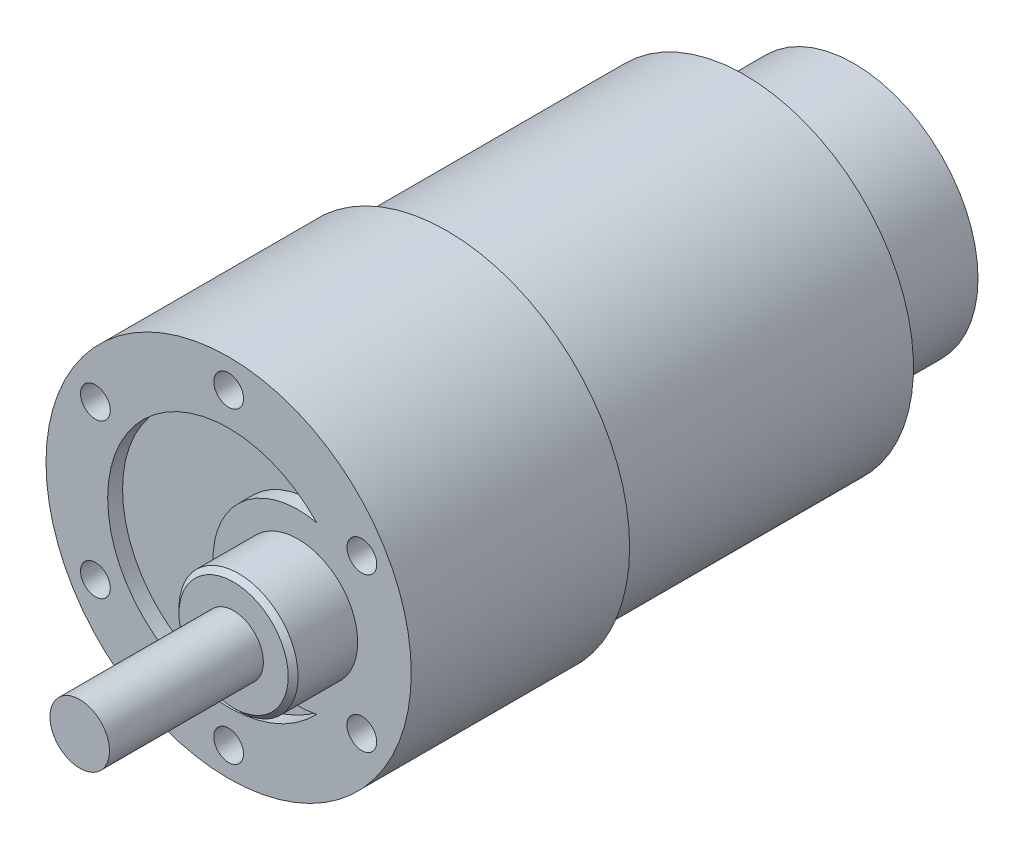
ISO-10303-21;
HEADER;
FILE_DESCRIPTION(('STEP AP214'),'2;1');
FILE_NAME('part.step','',(''),(''),'','','');
FILE_SCHEMA(('AUTOMOTIVE_DESIGN { 1 0 10303 214 1 1 1 1 }'));
ENDSEC;
DATA;
#1=APPLICATION_CONTEXT('core data for automotive mechanical design processes');
#2=APPLICATION_PROTOCOL_DEFINITION('international standard','automotive_design',2000,#1);
#3=PRODUCT_CONTEXT('',#1,'mechanical');
#4=PRODUCT('Part','Part','',(#3));
#5=PRODUCT_RELATED_PRODUCT_CATEGORY('part','',(#4));
#6=PRODUCT_DEFINITION_FORMATION('','',#4);
#7=PRODUCT_DEFINITION_CONTEXT('part definition',#1,'design');
#8=PRODUCT_DEFINITION('design','',#6,#7);
#9=PRODUCT_DEFINITION_SHAPE('','',#8);
#10=(LENGTH_UNIT() NAMED_UNIT(*) SI_UNIT(.MILLI.,.METRE.));
#11=(NAMED_UNIT(*) PLANE_ANGLE_UNIT() SI_UNIT($,.RADIAN.));
#12=(NAMED_UNIT(*) SI_UNIT($,.STERADIAN.) SOLID_ANGLE_UNIT());
#13=UNCERTAINTY_MEASURE_WITH_UNIT(LENGTH_MEASURE(1.E-05),#10,'distance_accuracy_value','');
#14=(GEOMETRIC_REPRESENTATION_CONTEXT(3) GLOBAL_UNCERTAINTY_ASSIGNED_CONTEXT((#13)) GLOBAL_UNIT_ASSIGNED_CONTEXT((#10,
#11,#12)) REPRESENTATION_CONTEXT('',''));
#15=CARTESIAN_POINT('',(0.,0.,0.));
#16=DIRECTION('',(0.,0.,1.));
#17=DIRECTION('',(1.,0.,0.));
#18=AXIS2_PLACEMENT_3D('',#15,#16,#17);
#19=CARTESIAN_POINT('',(0.,0.,0.));
#20=DIRECTION('',(0.,0.,-1.));
#21=DIRECTION('',(-1.,0.,0.));
#22=AXIS2_PLACEMENT_3D('',#19,#20,#21);
#23=PLANE('',#22);
#24=CARTESIAN_POINT('',(0.,0.,0.));
#25=DIRECTION('',(0.,0.,-1.));
#26=DIRECTION('',(-1.,0.,0.));
#27=AXIS2_PLACEMENT_3D('',#24,#25,#26);
#28=CIRCLE('',#27,17.);
#29=CARTESIAN_POINT('',(-17.,0.,0.));
#30=VERTEX_POINT('',#29);
#31=EDGE_CURVE('E87',#30,#30,#28,.T.);
#32=ORIENTED_EDGE('',*,*,#31,.T.);
#33=EDGE_LOOP('',(#32));
#34=FACE_BOUND('',#33,.T.);
#35=CARTESIAN_POINT('',(0.,0.,0.));
#36=DIRECTION('',(0.,0.,-1.));
#37=DIRECTION('',(-1.,0.,0.));
#38=AXIS2_PLACEMENT_3D('',#35,#36,#37);
#39=CIRCLE('',#38,12.5);
#40=CARTESIAN_POINT('',(-12.5,0.,0.));
#41=VERTEX_POINT('',#40);
#42=EDGE_CURVE('E64',#41,#41,#39,.T.);
#43=ORIENTED_EDGE('',*,*,#42,.F.);
#44=EDGE_LOOP('',(#43));
#45=FACE_BOUND('',#44,.T.);
#46=ADVANCED_FACE('F33',(#34,#45),#23,.T.);
#47=CARTESIAN_POINT('',(0.,0.,52.));
#48=DIRECTION('',(0.,0.,-1.));
#49=DIRECTION('',(-1.,0.,0.));
#50=AXIS2_PLACEMENT_3D('',#47,#48,#49);
#51=CYLINDRICAL_SURFACE('',#50,18.4);
#52=CARTESIAN_POINT('',(0.,0.,52.));
#53=DIRECTION('',(0.,0.,-1.));
#54=DIRECTION('',(-1.,0.,0.));
#55=AXIS2_PLACEMENT_3D('',#52,#53,#54);
#56=CIRCLE('',#55,18.4);
#57=CARTESIAN_POINT('',(-18.4,0.,52.));
#58=VERTEX_POINT('',#57);
#59=EDGE_CURVE('E101',#58,#58,#56,.T.);
#60=ORIENTED_EDGE('',*,*,#59,.T.);
#61=EDGE_LOOP('',(#60));
#62=FACE_BOUND('',#61,.T.);
#63=CARTESIAN_POINT('',(0.,0.,30.));
#64=DIRECTION('',(0.,0.,-1.));
#65=DIRECTION('',(-1.,0.,0.));
#66=AXIS2_PLACEMENT_3D('',#63,#64,#65);
#67=CIRCLE('',#66,18.4);
#68=CARTESIAN_POINT('',(-18.4,0.,30.));
#69=VERTEX_POINT('',#68);
#70=EDGE_CURVE('E92',#69,#69,#67,.T.);
#71=ORIENTED_EDGE('',*,*,#70,.F.);
#72=EDGE_LOOP('',(#71));
#73=FACE_BOUND('',#72,.T.);
#74=ADVANCED_FACE('F123',(#62,#73),#51,.T.);
#75=CARTESIAN_POINT('',(18.4,0.,52.));
#76=DIRECTION('',(0.,0.,1.));
#77=DIRECTION('',(1.,0.,0.));
#78=AXIS2_PLACEMENT_3D('',#75,#76,#77);
#79=PLANE('',#78);
#80=CARTESIAN_POINT('',(-13.4233937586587,7.75000000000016,52.));
#81=DIRECTION('',(0.,0.,1.));
#82=DIRECTION('',(1.,0.,0.));
#83=AXIS2_PLACEMENT_3D('',#80,#81,#82);
#84=CIRCLE('',#83,1.49999999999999);
#85=CARTESIAN_POINT('',(-11.9233937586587,7.75000000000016,52.));
#86=VERTEX_POINT('',#85);
#87=EDGE_CURVE('E154',#86,#86,#84,.T.);
#88=ORIENTED_EDGE('',*,*,#87,.F.);
#89=EDGE_LOOP('',(#88));
#90=FACE_BOUND('',#89,.T.);
#91=CARTESIAN_POINT('',(-13.4233937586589,-7.74999999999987,52.));
#92=DIRECTION('',(0.,0.,1.));
#93=DIRECTION('',(1.,0.,0.));
#94=AXIS2_PLACEMENT_3D('',#91,#92,#93);
#95=CIRCLE('',#94,1.49999999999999);
#96=CARTESIAN_POINT('',(-11.9233937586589,-7.74999999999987,52.));
#97=VERTEX_POINT('',#96);
#98=EDGE_CURVE('E158',#97,#97,#95,.T.);
#99=ORIENTED_EDGE('',*,*,#98,.F.);
#100=EDGE_LOOP('',(#99));
#101=FACE_BOUND('',#100,.T.);
#102=CARTESIAN_POINT('',(-1.08235921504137E-13,-15.5,52.));
#103=DIRECTION('',(0.,0.,1.));
#104=DIRECTION('',(1.,0.,0.));
#105=AXIS2_PLACEMENT_3D('',#102,#103,#104);
#106=CIRCLE('',#105,1.49999999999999);
#107=CARTESIAN_POINT('',(1.49999999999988,-15.5,52.));
#108=VERTEX_POINT('',#107);
#109=EDGE_CURVE('E162',#108,#108,#106,.T.);
#110=ORIENTED_EDGE('',*,*,#109,.F.);
#111=EDGE_LOOP('',(#110));
#112=FACE_BOUND('',#111,.T.);
#113=CARTESIAN_POINT('',(13.4233937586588,-7.75000000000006,52.));
#114=DIRECTION('',(0.,0.,1.));
#115=DIRECTION('',(1.,0.,0.));
#116=AXIS2_PLACEMENT_3D('',#113,#114,#115);
#117=CIRCLE('',#116,1.49999999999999);
#118=CARTESIAN_POINT('',(14.9233937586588,-7.75000000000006,52.));
#119=VERTEX_POINT('',#118);
#120=EDGE_CURVE('E166',#119,#119,#117,.T.);
#121=ORIENTED_EDGE('',*,*,#120,.F.);
#122=EDGE_LOOP('',(#121));
#123=FACE_BOUND('',#122,.T.);
#124=CARTESIAN_POINT('',(13.4233937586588,7.74999999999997,52.));
#125=DIRECTION('',(0.,0.,1.));
#126=DIRECTION('',(1.,0.,0.));
#127=AXIS2_PLACEMENT_3D('',#124,#125,#126);
#128=CIRCLE('',#127,1.49999999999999);
#129=CARTESIAN_POINT('',(14.9233937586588,7.74999999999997,52.));
#130=VERTEX_POINT('',#129);
#131=EDGE_CURVE('E170',#130,#130,#128,.T.);
#132=ORIENTED_EDGE('',*,*,#131,.F.);
#133=EDGE_LOOP('',(#132));
#134=FACE_BOUND('',#133,.T.);
#135=CARTESIAN_POINT('',(0.,15.5,52.));
#136=DIRECTION('',(0.,0.,1.));
#137=DIRECTION('',(1.,0.,0.));
#138=AXIS2_PLACEMENT_3D('',#135,#136,#137);
#139=CIRCLE('',#138,1.49999999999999);
#140=CARTESIAN_POINT('',(1.49999999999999,15.5,52.));
#141=VERTEX_POINT('',#140);
#142=EDGE_CURVE('E174',#141,#141,#139,.T.);
#143=ORIENTED_EDGE('',*,*,#142,.F.);
#144=EDGE_LOOP('',(#143));
#145=FACE_BOUND('',#144,.T.);
#146=CARTESIAN_POINT('',(7.,0.,52.));
#147=DIRECTION('',(0.,0.,1.));
#148=DIRECTION('',(1.,0.,0.));
#149=AXIS2_PLACEMENT_3D('',#146,#147,#148);
#150=CIRCLE('',#149,6.);
#151=CARTESIAN_POINT('',(13.,0.,52.));
#152=VERTEX_POINT('',#151);
#153=EDGE_CURVE('E104',#152,#152,#150,.T.);
#154=ORIENTED_EDGE('',*,*,#153,.F.);
#155=EDGE_LOOP('',(#154));
#156=FACE_BOUND('',#155,.T.);
#157=CARTESIAN_POINT('',(7.,0.,52.));
#158=DIRECTION('',(0.,0.,-1.));
#159=DIRECTION('',(-1.,0.,0.));
#160=AXIS2_PLACEMENT_3D('',#157,#158,#159);
#161=CIRCLE('',#160,8.56590718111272);
#162=CARTESIAN_POINT('',(8.86813473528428,-8.35971521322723,52.));
#163=VERTEX_POINT('',#162);
#164=CARTESIAN_POINT('',(8.86813473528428,8.35971521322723,52.));
#165=VERTEX_POINT('',#164);
#166=EDGE_CURVE('E48',#163,#165,#161,.T.);
#167=ORIENTED_EDGE('',*,*,#166,.F.);
#168=CARTESIAN_POINT('',(0.,0.,52.));
#169=DIRECTION('',(0.,0.,1.));
#170=DIRECTION('',(1.,0.,0.));
#171=AXIS2_PLACEMENT_3D('',#168,#169,#170);
#172=CIRCLE('',#171,12.1872331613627);
#173=EDGE_CURVE('E68',#165,#163,#172,.T.);
#174=ORIENTED_EDGE('',*,*,#173,.F.);
#175=EDGE_LOOP('',(#167,#174));
#176=FACE_BOUND('',#175,.T.);
#177=ORIENTED_EDGE('',*,*,#59,.F.);
#178=EDGE_LOOP('',(#177));
#179=FACE_BOUND('',#178,.T.);
#180=ADVANCED_FACE('F72',(#90,#101,#112,#123,#134,#145,#156,#176,#179),#79,.T.);
#181=CARTESIAN_POINT('',(0.,0.,29.));
#182=DIRECTION('',(0.,0.,-1.));
#183=DIRECTION('',(-1.,0.,0.));
#184=AXIS2_PLACEMENT_3D('',#181,#182,#183);
#185=TOROIDAL_SURFACE('',#184,16.,1.);
#186=CARTESIAN_POINT('',(0.,0.,30.));
#187=DIRECTION('',(0.,0.,-1.));
#188=DIRECTION('',(-1.,0.,0.));
#189=AXIS2_PLACEMENT_3D('',#186,#187,#188);
#190=CIRCLE('',#189,16.);
#191=CARTESIAN_POINT('',(-16.,0.,30.));
#192=VERTEX_POINT('',#191);
#193=EDGE_CURVE('E95',#192,#192,#190,.T.);
#194=ORIENTED_EDGE('',*,*,#193,.T.);
#195=EDGE_LOOP('',(#194));
#196=FACE_BOUND('',#195,.T.);
#197=CARTESIAN_POINT('',(0.,0.,29.));
#198=DIRECTION('',(0.,0.,-1.));
#199=DIRECTION('',(-1.,0.,0.));
#200=AXIS2_PLACEMENT_3D('',#197,#198,#199);
#201=CIRCLE('',#200,17.);
#202=CARTESIAN_POINT('',(-17.,0.,29.));
#203=VERTEX_POINT('',#202);
#204=EDGE_CURVE('E98',#203,#203,#201,.T.);
#205=ORIENTED_EDGE('',*,*,#204,.F.);
#206=EDGE_LOOP('',(#205));
#207=FACE_BOUND('',#206,.T.);
#208=ADVANCED_FACE('F142',(#196,#207),#185,.T.);
#209=CARTESIAN_POINT('',(16.,0.,30.));
#210=DIRECTION('',(0.,0.,-1.));
#211=DIRECTION('',(-1.,0.,0.));
#212=AXIS2_PLACEMENT_3D('',#209,#210,#211);
#213=PLANE('',#212);
#214=ORIENTED_EDGE('',*,*,#70,.T.);
#215=EDGE_LOOP('',(#214));
#216=FACE_BOUND('',#215,.T.);
#217=ORIENTED_EDGE('',*,*,#193,.F.);
#218=EDGE_LOOP('',(#217));
#219=FACE_BOUND('',#218,.T.);
#220=ADVANCED_FACE('F138',(#216,#219),#213,.T.);
#221=CARTESIAN_POINT('',(0.,0.,0.));
#222=DIRECTION('',(0.,0.,1.));
#223=DIRECTION('',(1.,0.,0.));
#224=AXIS2_PLACEMENT_3D('',#221,#222,#223);
#225=CYLINDRICAL_SURFACE('',#224,17.);
#226=ORIENTED_EDGE('',*,*,#31,.F.);
#227=EDGE_LOOP('',(#226));
#228=FACE_BOUND('',#227,.T.);
#229=ORIENTED_EDGE('',*,*,#204,.T.);
#230=EDGE_LOOP('',(#229));
#231=FACE_BOUND('',#230,.T.);
#232=ADVANCED_FACE('F135',(#228,#231),#225,.T.);
#233=CARTESIAN_POINT('',(0.,0.,-11.));
#234=DIRECTION('',(0.,0.,1.));
#235=DIRECTION('',(1.,0.,0.));
#236=AXIS2_PLACEMENT_3D('',#233,#234,#235);
#237=CYLINDRICAL_SURFACE('',#236,12.5);
#238=CARTESIAN_POINT('',(0.,0.,-11.));
#239=DIRECTION('',(0.,0.,-1.));
#240=DIRECTION('',(-1.,0.,0.));
#241=AXIS2_PLACEMENT_3D('',#238,#239,#240);
#242=CIRCLE('',#241,12.5);
#243=CARTESIAN_POINT('',(-12.5,0.,-11.));
#244=VERTEX_POINT('',#243);
#245=EDGE_CURVE('E84',#244,#244,#242,.T.);
#246=ORIENTED_EDGE('',*,*,#245,.F.);
#247=EDGE_LOOP('',(#246));
#248=FACE_BOUND('',#247,.T.);
#249=ORIENTED_EDGE('',*,*,#42,.T.);
#250=EDGE_LOOP('',(#249));
#251=FACE_BOUND('',#250,.T.);
#252=ADVANCED_FACE('F133',(#248,#251),#237,.T.);
#253=CARTESIAN_POINT('',(0.,0.,-11.));
#254=DIRECTION('',(0.,0.,-1.));
#255=DIRECTION('',(-1.,0.,0.));
#256=AXIS2_PLACEMENT_3D('',#253,#254,#255);
#257=PLANE('',#256);
#258=ORIENTED_EDGE('',*,*,#245,.T.);
#259=EDGE_LOOP('',(#258));
#260=FACE_BOUND('',#259,.T.);
#261=ADVANCED_FACE('F202',(#260),#257,.T.);
#262=CARTESIAN_POINT('',(7.,0.,50.5));
#263=DIRECTION('',(0.,0.,1.));
#264=DIRECTION('',(1.,0.,0.));
#265=AXIS2_PLACEMENT_3D('',#262,#263,#264);
#266=CYLINDRICAL_SURFACE('',#265,8.56590718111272);
#267=ORIENTED_EDGE('',*,*,#166,.T.);
#268=DIRECTION('',(0.,0.,1.));
#269=VECTOR('',#268,1.);
#270=CARTESIAN_POINT('',(8.86813473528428,8.35971521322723,50.5));
#271=LINE('',#270,#269);
#272=CARTESIAN_POINT('',(8.86813473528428,8.35971521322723,50.5));
#273=VERTEX_POINT('',#272);
#274=EDGE_CURVE('E65',#273,#165,#271,.T.);
#275=ORIENTED_EDGE('',*,*,#274,.F.);
#276=CARTESIAN_POINT('',(7.,0.,50.5));
#277=DIRECTION('',(0.,0.,-1.));
#278=DIRECTION('',(-1.,0.,0.));
#279=AXIS2_PLACEMENT_3D('',#276,#277,#278);
#280=CIRCLE('',#279,8.56590718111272);
#281=CARTESIAN_POINT('',(8.86813473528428,-8.35971521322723,50.5));
#282=VERTEX_POINT('',#281);
#283=EDGE_CURVE('E62',#282,#273,#280,.T.);
#284=ORIENTED_EDGE('',*,*,#283,.F.);
#285=DIRECTION('',(0.,0.,1.));
#286=VECTOR('',#285,1.);
#287=CARTESIAN_POINT('',(8.86813473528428,-8.35971521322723,50.5));
#288=LINE('',#287,#286);
#289=EDGE_CURVE('E56',#282,#163,#288,.T.);
#290=ORIENTED_EDGE('',*,*,#289,.T.);
#291=EDGE_LOOP('',(#267,#275,#284,#290));
#292=FACE_BOUND('',#291,.T.);
#293=ADVANCED_FACE('F60',(#292),#266,.T.);
#294=CARTESIAN_POINT('',(0.,0.,50.5));
#295=DIRECTION('',(0.,0.,1.));
#296=DIRECTION('',(1.,0.,0.));
#297=AXIS2_PLACEMENT_3D('',#294,#295,#296);
#298=CYLINDRICAL_SURFACE('',#297,12.1872331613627);
#299=ORIENTED_EDGE('',*,*,#173,.T.);
#300=ORIENTED_EDGE('',*,*,#289,.F.);
#301=CARTESIAN_POINT('',(0.,0.,50.5));
#302=DIRECTION('',(0.,0.,1.));
#303=DIRECTION('',(1.,0.,0.));
#304=AXIS2_PLACEMENT_3D('',#301,#302,#303);
#305=CIRCLE('',#304,12.1872331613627);
#306=EDGE_CURVE('E80',#273,#282,#305,.T.);
#307=ORIENTED_EDGE('',*,*,#306,.F.);
#308=ORIENTED_EDGE('',*,*,#274,.T.);
#309=EDGE_LOOP('',(#299,#300,#307,#308));
#310=FACE_BOUND('',#309,.T.);
#311=ADVANCED_FACE('F69',(#310),#298,.F.);
#312=CARTESIAN_POINT('',(3.5,0.,50.5));
#313=DIRECTION('',(0.,0.,-1.));
#314=DIRECTION('',(-1.,0.,0.));
#315=AXIS2_PLACEMENT_3D('',#312,#313,#314);
#316=PLANE('',#315);
#317=ORIENTED_EDGE('',*,*,#283,.T.);
#318=ORIENTED_EDGE('',*,*,#306,.T.);
#319=EDGE_LOOP('',(#317,#318));
#320=FACE_BOUND('',#319,.T.);
#321=ADVANCED_FACE('F194',(#320),#316,.F.);
#322=CARTESIAN_POINT('',(7.,0.,74.));
#323=DIRECTION('',(0.,0.,-1.));
#324=DIRECTION('',(-1.,0.,0.));
#325=AXIS2_PLACEMENT_3D('',#322,#323,#324);
#326=CYLINDRICAL_SURFACE('',#325,3.);
#327=CARTESIAN_POINT('',(7.,0.,74.));
#328=DIRECTION('',(0.,0.,-1.));
#329=DIRECTION('',(-1.,0.,0.));
#330=AXIS2_PLACEMENT_3D('',#327,#328,#329);
#331=CIRCLE('',#330,3.);
#332=CARTESIAN_POINT('',(4.,0.,74.));
#333=VERTEX_POINT('',#332);
#334=EDGE_CURVE('E74',#333,#333,#331,.T.);
#335=ORIENTED_EDGE('',*,*,#334,.T.);
#336=EDGE_LOOP('',(#335));
#337=FACE_BOUND('',#336,.T.);
#338=CARTESIAN_POINT('',(7.,0.,58.5));
#339=DIRECTION('',(0.,0.,-1.));
#340=DIRECTION('',(-1.,0.,0.));
#341=AXIS2_PLACEMENT_3D('',#338,#339,#340);
#342=CIRCLE('',#341,3.);
#343=CARTESIAN_POINT('',(4.,0.,58.5));
#344=VERTEX_POINT('',#343);
#345=EDGE_CURVE('E77',#344,#344,#342,.T.);
#346=ORIENTED_EDGE('',*,*,#345,.F.);
#347=EDGE_LOOP('',(#346));
#348=FACE_BOUND('',#347,.T.);
#349=ADVANCED_FACE('F187',(#337,#348),#326,.T.);
#350=CARTESIAN_POINT('',(10.,0.,74.));
#351=DIRECTION('',(0.,0.,1.));
#352=DIRECTION('',(1.,0.,0.));
#353=AXIS2_PLACEMENT_3D('',#350,#351,#352);
#354=PLANE('',#353);
#355=ORIENTED_EDGE('',*,*,#334,.F.);
#356=EDGE_LOOP('',(#355));
#357=FACE_BOUND('',#356,.T.);
#358=ADVANCED_FACE('F178',(#357),#354,.T.);
#359=CARTESIAN_POINT('',(7.,0.,74.));
#360=DIRECTION('',(0.,0.,-1.));
#361=DIRECTION('',(-1.,0.,0.));
#362=AXIS2_PLACEMENT_3D('',#359,#360,#361);
#363=CYLINDRICAL_SURFACE('',#362,6.);
#364=CARTESIAN_POINT('',(7.,0.,57.9999999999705));
#365=DIRECTION('',(0.,0.,1.));
#366=DIRECTION('',(1.,0.,0.));
#367=AXIS2_PLACEMENT_3D('',#364,#365,#366);
#368=CIRCLE('',#367,6.);
#369=CARTESIAN_POINT('',(13.,0.,57.9999999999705));
#370=VERTEX_POINT('',#369);
#371=EDGE_CURVE('E41',#370,#370,#368,.F.);
#372=ORIENTED_EDGE('',*,*,#371,.T.);
#373=EDGE_LOOP('',(#372));
#374=FACE_BOUND('',#373,.T.);
#375=ORIENTED_EDGE('',*,*,#153,.T.);
#376=EDGE_LOOP('',(#375));
#377=FACE_BOUND('',#376,.T.);
#378=ADVANCED_FACE('F109',(#374,#377),#363,.T.);
#379=CARTESIAN_POINT('',(13.,0.,58.5));
#380=DIRECTION('',(0.,0.,1.));
#381=DIRECTION('',(1.,0.,0.));
#382=AXIS2_PLACEMENT_3D('',#379,#380,#381);
#383=PLANE('',#382);
#384=CARTESIAN_POINT('',(7.,0.,58.5));
#385=DIRECTION('',(0.,0.,1.));
#386=DIRECTION('',(1.,0.,0.));
#387=AXIS2_PLACEMENT_3D('',#384,#385,#386);
#388=CIRCLE('',#387,5.50000000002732);
#389=CARTESIAN_POINT('',(12.5000000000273,0.,58.5));
#390=VERTEX_POINT('',#389);
#391=EDGE_CURVE('E11',#390,#390,#388,.T.);
#392=ORIENTED_EDGE('',*,*,#391,.T.);
#393=EDGE_LOOP('',(#392));
#394=FACE_BOUND('',#393,.T.);
#395=ORIENTED_EDGE('',*,*,#345,.T.);
#396=EDGE_LOOP('',(#395));
#397=FACE_BOUND('',#396,.T.);
#398=ADVANCED_FACE('F177',(#394,#397),#383,.T.);
#399=CARTESIAN_POINT('',(0.,15.5,49.));
#400=DIRECTION('',(0.,0.,-1.));
#401=DIRECTION('',(-1.,0.,0.));
#402=AXIS2_PLACEMENT_3D('',#399,#400,#401);
#403=PLANE('',#402);
#404=CARTESIAN_POINT('',(0.,15.5,49.));
#405=DIRECTION('',(0.,0.,1.));
#406=DIRECTION('',(1.,0.,0.));
#407=AXIS2_PLACEMENT_3D('',#404,#405,#406);
#408=CIRCLE('',#407,1.49999999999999);
#409=CARTESIAN_POINT('',(1.49999999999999,15.5,49.));
#410=VERTEX_POINT('',#409);
#411=EDGE_CURVE('E434',#410,#410,#408,.T.);
#412=ORIENTED_EDGE('',*,*,#411,.T.);
#413=EDGE_LOOP('',(#412));
#414=FACE_BOUND('',#413,.T.);
#415=ADVANCED_FACE('F184',(#414),#403,.F.);
#416=CARTESIAN_POINT('',(0.,15.5,52.));
#417=DIRECTION('',(0.,0.,1.));
#418=DIRECTION('',(1.,0.,0.));
#419=AXIS2_PLACEMENT_3D('',#416,#417,#418);
#420=CYLINDRICAL_SURFACE('',#419,1.49999999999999);
#421=ORIENTED_EDGE('',*,*,#411,.F.);
#422=EDGE_LOOP('',(#421));
#423=FACE_BOUND('',#422,.T.);
#424=ORIENTED_EDGE('',*,*,#142,.T.);
#425=EDGE_LOOP('',(#424));
#426=FACE_BOUND('',#425,.T.);
#427=ADVANCED_FACE('F249',(#423,#426),#420,.F.);
#428=CARTESIAN_POINT('',(13.4233937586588,7.74999999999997,49.));
#429=DIRECTION('',(0.,0.,-1.));
#430=DIRECTION('',(-1.,0.,0.));
#431=AXIS2_PLACEMENT_3D('',#428,#429,#430);
#432=PLANE('',#431);
#433=CARTESIAN_POINT('',(13.4233937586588,7.74999999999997,49.));
#434=DIRECTION('',(0.,0.,1.));
#435=DIRECTION('',(1.,0.,0.));
#436=AXIS2_PLACEMENT_3D('',#433,#434,#435);
#437=CIRCLE('',#436,1.49999999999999);
#438=CARTESIAN_POINT('',(14.9233937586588,7.74999999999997,49.));
#439=VERTEX_POINT('',#438);
#440=EDGE_CURVE('E430',#439,#439,#437,.T.);
#441=ORIENTED_EDGE('',*,*,#440,.T.);
#442=EDGE_LOOP('',(#441));
#443=FACE_BOUND('',#442,.T.);
#444=ADVANCED_FACE('F259',(#443),#432,.F.);
#445=CARTESIAN_POINT('',(13.4233937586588,7.74999999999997,52.));
#446=DIRECTION('',(0.,0.,1.));
#447=DIRECTION('',(1.,0.,0.));
#448=AXIS2_PLACEMENT_3D('',#445,#446,#447);
#449=CYLINDRICAL_SURFACE('',#448,1.49999999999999);
#450=ORIENTED_EDGE('',*,*,#440,.F.);
#451=EDGE_LOOP('',(#450));
#452=FACE_BOUND('',#451,.T.);
#453=ORIENTED_EDGE('',*,*,#131,.T.);
#454=EDGE_LOOP('',(#453));
#455=FACE_BOUND('',#454,.T.);
#456=ADVANCED_FACE('F269',(#452,#455),#449,.F.);
#457=CARTESIAN_POINT('',(13.4233937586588,-7.75000000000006,49.));
#458=DIRECTION('',(0.,0.,-1.));
#459=DIRECTION('',(-1.,0.,0.));
#460=AXIS2_PLACEMENT_3D('',#457,#458,#459);
#461=PLANE('',#460);
#462=CARTESIAN_POINT('',(13.4233937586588,-7.75000000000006,49.));
#463=DIRECTION('',(0.,0.,1.));
#464=DIRECTION('',(1.,0.,0.));
#465=AXIS2_PLACEMENT_3D('',#462,#463,#464);
#466=CIRCLE('',#465,1.49999999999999);
#467=CARTESIAN_POINT('',(14.9233937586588,-7.75000000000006,49.));
#468=VERTEX_POINT('',#467);
#469=EDGE_CURVE('E426',#468,#468,#466,.T.);
#470=ORIENTED_EDGE('',*,*,#469,.T.);
#471=EDGE_LOOP('',(#470));
#472=FACE_BOUND('',#471,.T.);
#473=ADVANCED_FACE('F279',(#472),#461,.F.);
#474=CARTESIAN_POINT('',(13.4233937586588,-7.75000000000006,52.));
#475=DIRECTION('',(0.,0.,1.));
#476=DIRECTION('',(1.,0.,0.));
#477=AXIS2_PLACEMENT_3D('',#474,#475,#476);
#478=CYLINDRICAL_SURFACE('',#477,1.49999999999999);
#479=ORIENTED_EDGE('',*,*,#469,.F.);
#480=EDGE_LOOP('',(#479));
#481=FACE_BOUND('',#480,.T.);
#482=ORIENTED_EDGE('',*,*,#120,.T.);
#483=EDGE_LOOP('',(#482));
#484=FACE_BOUND('',#483,.T.);
#485=ADVANCED_FACE('F289',(#481,#484),#478,.F.);
#486=CARTESIAN_POINT('',(-1.08970709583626E-13,-15.5,49.));
#487=DIRECTION('',(0.,0.,-1.));
#488=DIRECTION('',(-1.,0.,0.));
#489=AXIS2_PLACEMENT_3D('',#486,#487,#488);
#490=PLANE('',#489);
#491=CARTESIAN_POINT('',(-1.08235921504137E-13,-15.5,49.));
#492=DIRECTION('',(0.,0.,1.));
#493=DIRECTION('',(1.,0.,0.));
#494=AXIS2_PLACEMENT_3D('',#491,#492,#493);
#495=CIRCLE('',#494,1.49999999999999);
#496=CARTESIAN_POINT('',(1.49999999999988,-15.5,49.));
#497=VERTEX_POINT('',#496);
#498=EDGE_CURVE('E422',#497,#497,#495,.T.);
#499=ORIENTED_EDGE('',*,*,#498,.T.);
#500=EDGE_LOOP('',(#499));
#501=FACE_BOUND('',#500,.T.);
#502=ADVANCED_FACE('F299',(#501),#490,.F.);
#503=CARTESIAN_POINT('',(-1.08235921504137E-13,-15.5,52.));
#504=DIRECTION('',(0.,0.,1.));
#505=DIRECTION('',(1.,0.,0.));
#506=AXIS2_PLACEMENT_3D('',#503,#504,#505);
#507=CYLINDRICAL_SURFACE('',#506,1.49999999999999);
#508=ORIENTED_EDGE('',*,*,#498,.F.);
#509=EDGE_LOOP('',(#508));
#510=FACE_BOUND('',#509,.T.);
#511=ORIENTED_EDGE('',*,*,#109,.T.);
#512=EDGE_LOOP('',(#511));
#513=FACE_BOUND('',#512,.T.);
#514=ADVANCED_FACE('F309',(#510,#513),#507,.F.);
#515=CARTESIAN_POINT('',(-13.4233937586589,-7.74999999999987,49.));
#516=DIRECTION('',(0.,0.,-1.));
#517=DIRECTION('',(-1.,0.,0.));
#518=AXIS2_PLACEMENT_3D('',#515,#516,#517);
#519=PLANE('',#518);
#520=CARTESIAN_POINT('',(-13.4233937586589,-7.74999999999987,49.));
#521=DIRECTION('',(0.,0.,1.));
#522=DIRECTION('',(1.,0.,0.));
#523=AXIS2_PLACEMENT_3D('',#520,#521,#522);
#524=CIRCLE('',#523,1.49999999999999);
#525=CARTESIAN_POINT('',(-11.9233937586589,-7.74999999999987,49.));
#526=VERTEX_POINT('',#525);
#527=EDGE_CURVE('E415',#526,#526,#524,.T.);
#528=ORIENTED_EDGE('',*,*,#527,.T.);
#529=EDGE_LOOP('',(#528));
#530=FACE_BOUND('',#529,.T.);
#531=ADVANCED_FACE('F319',(#530),#519,.F.);
#532=CARTESIAN_POINT('',(-13.4233937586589,-7.74999999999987,52.));
#533=DIRECTION('',(0.,0.,1.));
#534=DIRECTION('',(1.,0.,0.));
#535=AXIS2_PLACEMENT_3D('',#532,#533,#534);
#536=CYLINDRICAL_SURFACE('',#535,1.49999999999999);
#537=ORIENTED_EDGE('',*,*,#527,.F.);
#538=EDGE_LOOP('',(#537));
#539=FACE_BOUND('',#538,.T.);
#540=ORIENTED_EDGE('',*,*,#98,.T.);
#541=EDGE_LOOP('',(#540));
#542=FACE_BOUND('',#541,.T.);
#543=ADVANCED_FACE('F329',(#539,#542),#536,.F.);
#544=CARTESIAN_POINT('',(-13.4233937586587,7.75000000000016,49.));
#545=DIRECTION('',(0.,0.,-1.));
#546=DIRECTION('',(-1.,0.,0.));
#547=AXIS2_PLACEMENT_3D('',#544,#545,#546);
#548=PLANE('',#547);
#549=CARTESIAN_POINT('',(-13.4233937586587,7.75000000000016,49.));
#550=DIRECTION('',(0.,0.,1.));
#551=DIRECTION('',(1.,0.,0.));
#552=AXIS2_PLACEMENT_3D('',#549,#550,#551);
#553=CIRCLE('',#552,1.49999999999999);
#554=CARTESIAN_POINT('',(-11.9233937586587,7.75000000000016,49.));
#555=VERTEX_POINT('',#554);
#556=EDGE_CURVE('E413',#555,#555,#553,.T.);
#557=ORIENTED_EDGE('',*,*,#556,.T.);
#558=EDGE_LOOP('',(#557));
#559=FACE_BOUND('',#558,.T.);
#560=ADVANCED_FACE('F118',(#559),#548,.F.);
#561=CARTESIAN_POINT('',(-13.4233937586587,7.75000000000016,52.));
#562=DIRECTION('',(0.,0.,1.));
#563=DIRECTION('',(1.,0.,0.));
#564=AXIS2_PLACEMENT_3D('',#561,#562,#563);
#565=CYLINDRICAL_SURFACE('',#564,1.49999999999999);
#566=ORIENTED_EDGE('',*,*,#556,.F.);
#567=EDGE_LOOP('',(#566));
#568=FACE_BOUND('',#567,.T.);
#569=ORIENTED_EDGE('',*,*,#87,.T.);
#570=EDGE_LOOP('',(#569));
#571=FACE_BOUND('',#570,.T.);
#572=ADVANCED_FACE('F113',(#568,#571),#565,.F.);
#573=CARTESIAN_POINT('',(7.,0.,57.9999999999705));
#574=DIRECTION('',(0.,0.,-1.));
#575=DIRECTION('',(-1.,0.,0.));
#576=AXIS2_PLACEMENT_3D('',#573,#574,#575);
#577=CONICAL_SURFACE('',#576,6.,0.785398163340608);
#578=ORIENTED_EDGE('',*,*,#391,.F.);
#579=EDGE_LOOP('',(#578));
#580=FACE_BOUND('',#579,.T.);
#581=ORIENTED_EDGE('',*,*,#371,.F.);
#582=EDGE_LOOP('',(#581));
#583=FACE_BOUND('',#582,.T.);
#584=ADVANCED_FACE('F35',(#580,#583),#577,.T.);
#585=CLOSED_SHELL('',(#46,#74,#180,#208,#220,#232,#252,#261,#293,#311,#321,#349,#358,#378,#398,
#415,#427,#444,#456,#473,#485,#502,#514,#531,#543,#560,#572,#584));
#586=MANIFOLD_SOLID_BREP('B2',#585);
#587=ADVANCED_BREP_SHAPE_REPRESENTATION('',(#18,#586),#14);
#588=SHAPE_DEFINITION_REPRESENTATION(#9,#587);
ENDSEC;
END-ISO-10303-21;
